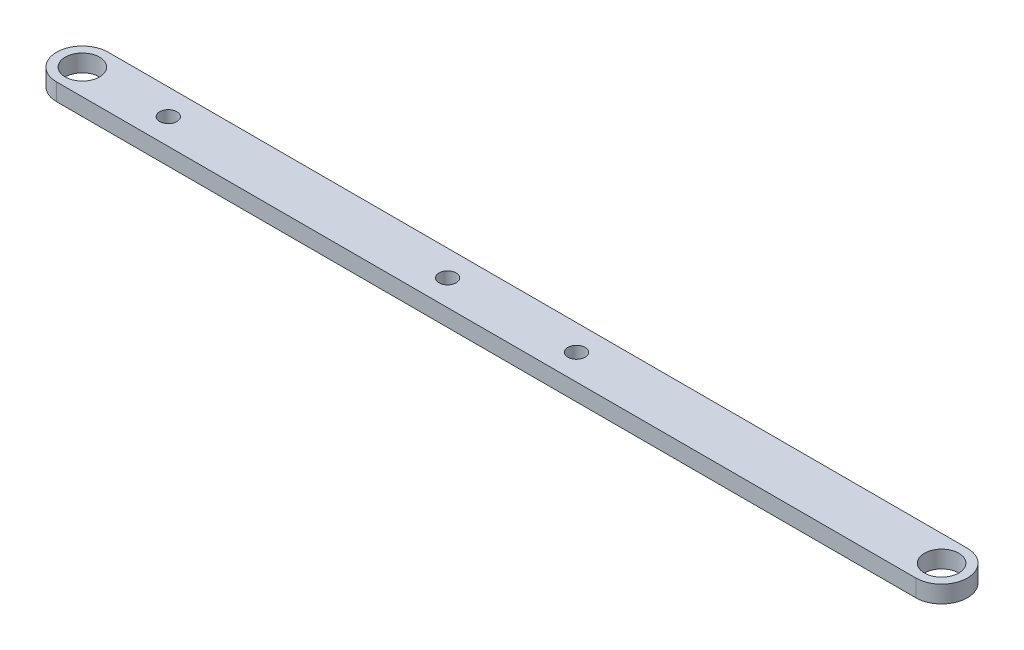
from build123d import *

# Parameters (mm, degrees)
SKETCH1_R      = 2
SKETCH1_R_2    = 1
EXTRUDE1_DEPTH = 2
SKETCH2_R      = 1
EXTRUDE2_DEPTH = 54.122499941


with BuildPart() as part:
    # Sketch1 → Extrude1 (new body)
    with BuildSketch(Plane(origin=(0, 0, 0), x_dir=(1, 0, 0), z_dir=(0, 1, 0))):
        with BuildLine():
            Line((-50, -3), (50, -3))
            ThreePointArc((50, -3), (53, 0), (50, 3))
            Line((50, 3), (-50, 3))
            ThreePointArc((-50, 3), (-53, 0), (-50, -3))
        make_face()
        with Locations(Location((-50, 0, 0), (0, 0, 270))):
            Circle(SKETCH1_R, mode=Mode.SUBTRACT)
        with Locations(Location((50, 0, 0), (0, 0, 270))):
            Circle(SKETCH1_R, mode=Mode.SUBTRACT)
        with Locations(Location((-7.5, 0, 0), (0, 0, 270))):
            Circle(SKETCH1_R_2, mode=Mode.SUBTRACT)
        with Locations(Location((7.5, 0, 0), (0, 0, 270))):
            Circle(SKETCH1_R_2, mode=Mode.SUBTRACT)
    extrude(amount=EXTRUDE1_DEPTH)

    # Sketch2 → Extrude2 (cut, through all)
    with BuildSketch(Plane(origin=(0, 2, 0), x_dir=(1, 0, 0), z_dir=(0, 1, 0))):
        with Locations(Location((-40, 0, 0), (0, 0, 270))):
            Circle(SKETCH2_R)
    extrude(amount=-EXTRUDE2_DEPTH, mode=Mode.SUBTRACT)


solid = part.part
